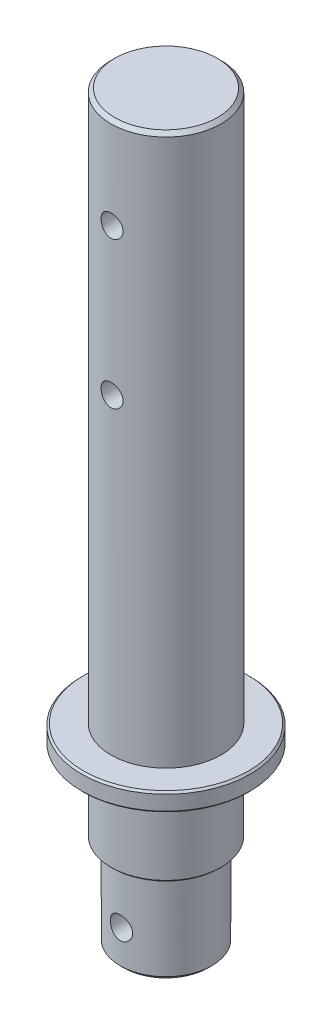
from build123d import *

# Parameters (mm, degrees)
CHANFREIN1_SIZE              = 1
ENL_V_MAT_EXTRU_1_DEPTH      = 205.602052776
ENL_V_MAT_EXTRU_1_DEPTH_BACK = 205.602052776
ESQUISSE2_R                  = 3
ESQUISSE2_R_2                = 3.05
CHANFREIN2_SIZE              = 0.5


with BuildPart() as part:
    # Esquisse1 → R_volution1 (revolve)
    with BuildSketch(Plane.XY, mode=Mode.PRIVATE) as r_volution1_sk:
        Polygon((-15, 47), (-15, 25), (-12.5, 25), (-12.5, 0), (0, 0), (0, 202), (-15, 202), (-15, 52), (-23, 52), (-23, 47), align=None)
    revolve(r_volution1_sk.sketch.rotate(Axis((0, 215.720868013, 0), (0, -1, 0)), 270), axis=Axis((0, 215.720868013, 0), (0, -1, 0)))

    # Chanfrein1
    chanfrein1_edges = [part.edges().sort_by_distance(p)[0] for p in [
        (0, 202, -15),
        (0, 0, -12.5),
    ]]
    chamfer(chanfrein1_edges, length=CHANFREIN1_SIZE)

    # Esquisse2 → Enl_v. mat.-Extru.1 (cut, two sides: drawn at the far end of the back side and taken through both)
    with BuildSketch(Plane.XY.offset(-ENL_V_MAT_EXTRU_1_DEPTH_BACK)):
        with Locations((0, 177)):
            Circle(ESQUISSE2_R)
        with Locations((0, 137)):
            Circle(ESQUISSE2_R)
        with Locations((0, 10)):
            Circle(ESQUISSE2_R_2)
    extrude(amount=ENL_V_MAT_EXTRU_1_DEPTH + ENL_V_MAT_EXTRU_1_DEPTH_BACK, mode=Mode.SUBTRACT)

    # Chanfrein2
    chanfrein2_edges = [part.edges().sort_by_distance(p)[0] for p in [
        (0, 25, -15),
        (0, 47, -23),
        (0, 52, -23),
    ]]
    chamfer(chanfrein2_edges, length=CHANFREIN2_SIZE)


solid = part.part
